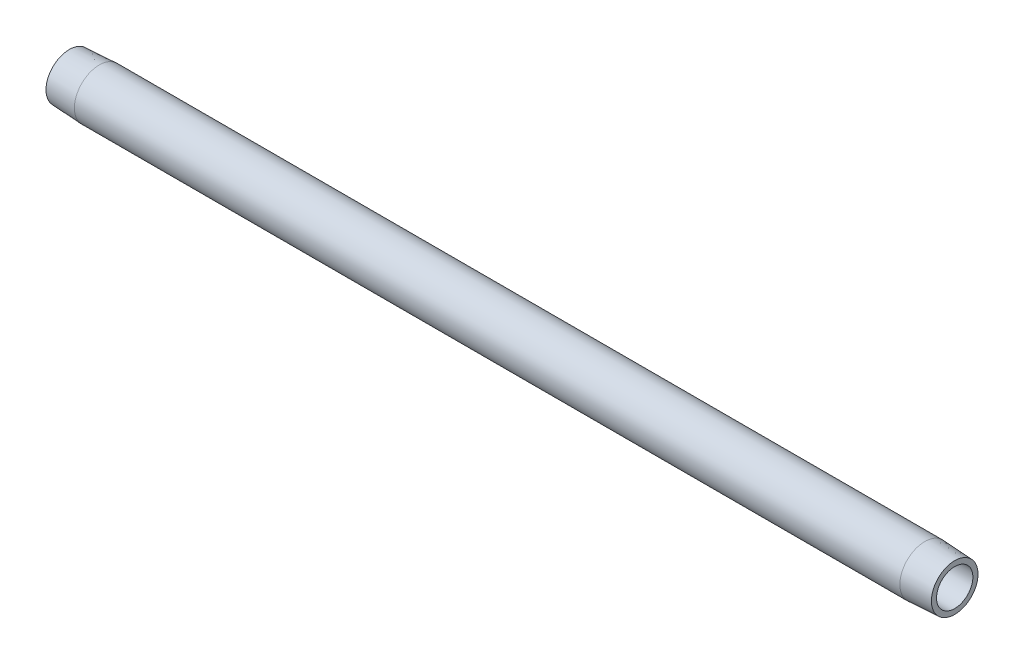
from build123d import *


with BuildPart() as part:
    # Sketch1 → Revolve1 (revolve)
    with BuildSketch(Plane.XY, mode=Mode.PRIVATE) as revolve1_sk:
        Polygon((304.8, 6.2611), (0, 6.2611), (0, 8.032050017), (10.3124, 8.5725), (294.4876, 8.5725), (304.8, 8.032050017), align=None)
    revolve(revolve1_sk.sketch.rotate(Axis((0, 0, 0), (1, 0, 0)), 90), axis=Axis((0, 0, 0), (1, 0, 0)))


solid = part.part
